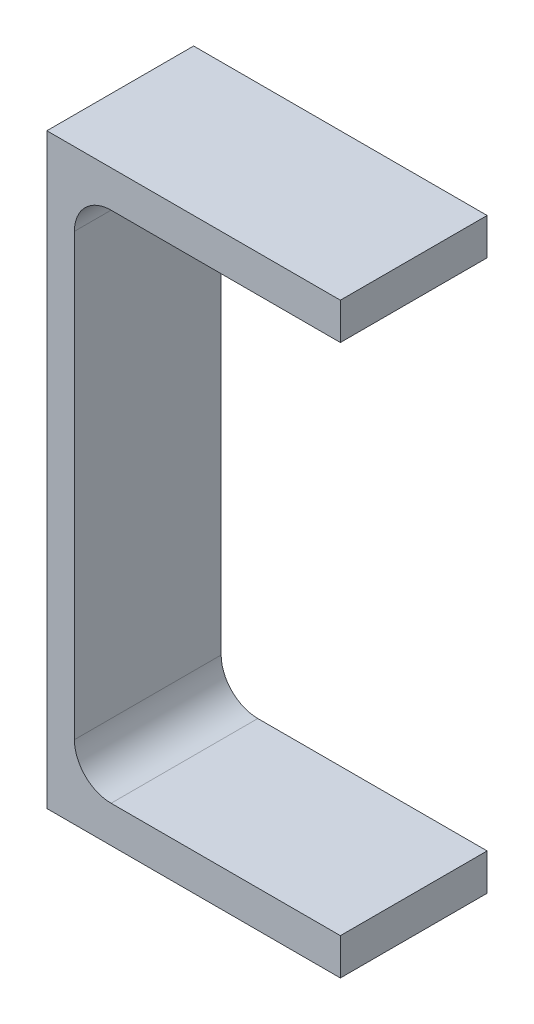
from build123d import *

# Parameters (mm, degrees)
BASECHANNELSE_DEPTH = 12.7


with BuildPart() as part:
    # Sketch1 → BaseChannelse (new, symmetric)
    with BuildSketch(Plane.XY):
        with BuildLine():
            Line((0, 0), (0, 101.6))
            Line((0, 101.6), (50.8, 101.6))
            Line((50.8, 101.6), (50.8, 95.25))
            Line((50.8, 95.25), (11.1125, 95.25))
            ThreePointArc((11.1125, 95.25), (6.622371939, 93.390128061), (4.7625, 88.9))
            Line((4.7625, 88.9), (4.7625, 12.7))
            ThreePointArc((4.7625, 12.7), (6.622371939, 8.209871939), (11.1125, 6.35))
            Line((11.1125, 6.35), (50.8, 6.35))
            Line((50.8, 6.35), (50.8, 0))
            Line((50.8, 0), (0, 0))
        make_face()
    extrude(amount=BASECHANNELSE_DEPTH, both=True)


solid = part.part
